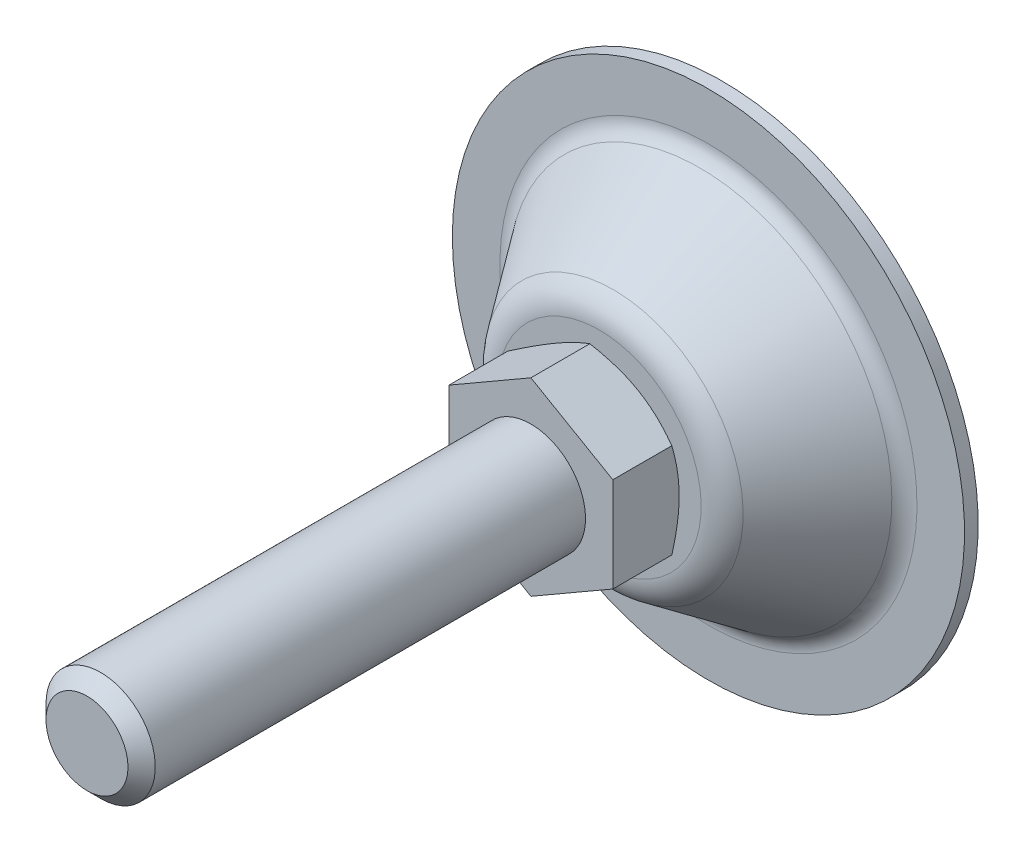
ISO-10303-21;
HEADER;
FILE_DESCRIPTION(('STEP AP214'),'2;1');
FILE_NAME('part.step','',(''),(''),'','','');
FILE_SCHEMA(('AUTOMOTIVE_DESIGN { 1 0 10303 214 1 1 1 1 }'));
ENDSEC;
DATA;
#1=APPLICATION_CONTEXT('core data for automotive mechanical design processes');
#2=APPLICATION_PROTOCOL_DEFINITION('international standard','automotive_design',2000,#1);
#3=PRODUCT_CONTEXT('',#1,'mechanical');
#4=PRODUCT('Part','Part','',(#3));
#5=PRODUCT_RELATED_PRODUCT_CATEGORY('part','',(#4));
#6=PRODUCT_DEFINITION_FORMATION('','',#4);
#7=PRODUCT_DEFINITION_CONTEXT('part definition',#1,'design');
#8=PRODUCT_DEFINITION('design','',#6,#7);
#9=PRODUCT_DEFINITION_SHAPE('','',#8);
#10=(LENGTH_UNIT() NAMED_UNIT(*) SI_UNIT(.MILLI.,.METRE.));
#11=(NAMED_UNIT(*) PLANE_ANGLE_UNIT() SI_UNIT($,.RADIAN.));
#12=(NAMED_UNIT(*) SI_UNIT($,.STERADIAN.) SOLID_ANGLE_UNIT());
#13=UNCERTAINTY_MEASURE_WITH_UNIT(LENGTH_MEASURE(1.E-05),#10,'distance_accuracy_value','');
#14=(GEOMETRIC_REPRESENTATION_CONTEXT(3) GLOBAL_UNCERTAINTY_ASSIGNED_CONTEXT((#13)) GLOBAL_UNIT_ASSIGNED_CONTEXT((#10,
#11,#12)) REPRESENTATION_CONTEXT('',''));
#15=CARTESIAN_POINT('',(0.,0.,0.));
#16=DIRECTION('',(0.,0.,1.));
#17=DIRECTION('',(1.,0.,0.));
#18=AXIS2_PLACEMENT_3D('',#15,#16,#17);
#19=CARTESIAN_POINT('',(0.,0.,28.));
#20=DIRECTION('',(0.,0.,1.));
#21=DIRECTION('',(0.5,-0.866025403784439,0.));
#22=AXIS2_PLACEMENT_3D('',#19,#20,#21);
#23=PLANE('',#22);
#24=DIRECTION('',(0.,1.,0.));
#25=VECTOR('',#24,1.);
#26=CARTESIAN_POINT('',(12.,-6.92820323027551,28.));
#27=LINE('',#26,#25);
#28=CARTESIAN_POINT('',(12.,-6.92820323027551,28.));
#29=VERTEX_POINT('',#28);
#30=CARTESIAN_POINT('',(12.,6.9282032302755,28.));
#31=VERTEX_POINT('',#30);
#32=EDGE_CURVE('E220',#29,#31,#27,.T.);
#33=ORIENTED_EDGE('',*,*,#32,.T.);
#34=DIRECTION('',(-0.866025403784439,0.5,0.));
#35=VECTOR('',#34,1.);
#36=CARTESIAN_POINT('',(12.,6.9282032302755,28.));
#37=LINE('',#36,#35);
#38=CARTESIAN_POINT('',(0.,13.856406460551,28.));
#39=VERTEX_POINT('',#38);
#40=EDGE_CURVE('E361',#31,#39,#37,.T.);
#41=ORIENTED_EDGE('',*,*,#40,.T.);
#42=DIRECTION('',(-0.866025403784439,-0.5,0.));
#43=VECTOR('',#42,1.);
#44=CARTESIAN_POINT('',(0.,13.856406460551,28.));
#45=LINE('',#44,#43);
#46=CARTESIAN_POINT('',(-12.,6.92820323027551,28.));
#47=VERTEX_POINT('',#46);
#48=EDGE_CURVE('E360',#39,#47,#45,.T.);
#49=ORIENTED_EDGE('',*,*,#48,.T.);
#50=DIRECTION('',(0.,-1.,0.));
#51=VECTOR('',#50,1.);
#52=CARTESIAN_POINT('',(-12.,6.92820323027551,28.));
#53=LINE('',#52,#51);
#54=CARTESIAN_POINT('',(-12.,-6.9282032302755,28.));
#55=VERTEX_POINT('',#54);
#56=EDGE_CURVE('E365',#47,#55,#53,.T.);
#57=ORIENTED_EDGE('',*,*,#56,.T.);
#58=DIRECTION('',(0.866025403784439,-0.5,0.));
#59=VECTOR('',#58,1.);
#60=CARTESIAN_POINT('',(-12.,-6.9282032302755,28.));
#61=LINE('',#60,#59);
#62=CARTESIAN_POINT('',(0.,-13.856406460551,28.));
#63=VERTEX_POINT('',#62);
#64=EDGE_CURVE('E367',#55,#63,#61,.T.);
#65=ORIENTED_EDGE('',*,*,#64,.T.);
#66=DIRECTION('',(0.866025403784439,0.5,0.));
#67=VECTOR('',#66,1.);
#68=CARTESIAN_POINT('',(0.,-13.856406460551,28.));
#69=LINE('',#68,#67);
#70=EDGE_CURVE('E37',#63,#29,#69,.T.);
#71=ORIENTED_EDGE('',*,*,#70,.T.);
#72=EDGE_LOOP('',(#33,#41,#49,#57,#65,#71));
#73=FACE_BOUND('',#72,.T.);
#74=CARTESIAN_POINT('',(0.,0.,28.));
#75=DIRECTION('',(0.,0.,1.));
#76=DIRECTION('',(0.5,-0.866025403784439,0.));
#77=AXIS2_PLACEMENT_3D('',#74,#75,#76);
#78=CIRCLE('',#77,8.);
#79=CARTESIAN_POINT('',(4.,-6.92820323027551,28.));
#80=VERTEX_POINT('',#79);
#81=EDGE_CURVE('E224',#80,#80,#78,.T.);
#82=ORIENTED_EDGE('',*,*,#81,.F.);
#83=EDGE_LOOP('',(#82));
#84=FACE_BOUND('',#83,.T.);
#85=ADVANCED_FACE('F14',(#73,#84),#23,.T.);
#86=CARTESIAN_POINT('',(-7.46811554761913,12.9351555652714,18.));
#87=DIRECTION('',(0.,0.,-1.));
#88=DIRECTION('',(-0.5,0.866025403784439,0.));
#89=AXIS2_PLACEMENT_3D('',#86,#87,#88);
#90=PLANE('',#89);
#91=CARTESIAN_POINT('',(-1.37317446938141E-13,2.37840794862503E-13,18.));
#92=DIRECTION('',(0.,0.,1.));
#93=DIRECTION('',(0.5,-0.866025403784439,0.));
#94=AXIS2_PLACEMENT_3D('',#91,#92,#93);
#95=CIRCLE('',#94,14.936231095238);
#96=CARTESIAN_POINT('',(7.46811554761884,-12.9351555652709,18.));
#97=VERTEX_POINT('',#96);
#98=EDGE_CURVE('E111',#97,#97,#95,.T.);
#99=ORIENTED_EDGE('',*,*,#98,.T.);
#100=EDGE_LOOP('',(#99));
#101=FACE_BOUND('',#100,.T.);
#102=CARTESIAN_POINT('',(0.,0.,18.));
#103=DIRECTION('',(0.,0.,-1.));
#104=DIRECTION('',(-0.5,0.866025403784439,0.));
#105=AXIS2_PLACEMENT_3D('',#102,#103,#104);
#106=CIRCLE('',#105,11.5);
#107=CARTESIAN_POINT('',(-5.75,9.95929214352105,18.));
#108=VERTEX_POINT('',#107);
#109=EDGE_CURVE('E84',#108,#108,#106,.T.);
#110=ORIENTED_EDGE('',*,*,#109,.T.);
#111=EDGE_LOOP('',(#110));
#112=FACE_BOUND('',#111,.T.);
#113=ADVANCED_FACE('F195',(#101,#112),#90,.F.);
#114=CARTESIAN_POINT('',(-1.54390389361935E-13,2.67411998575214E-13,4.9999999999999));
#115=DIRECTION('',(0.,0.,1.));
#116=DIRECTION('',(0.5,-0.866025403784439,0.));
#117=AXIS2_PLACEMENT_3D('',#114,#115,#116);
#118=TOROIDAL_SURFACE('',#117,30.5382613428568,3.);
#119=CARTESIAN_POINT('',(-1.55741344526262E-13,2.69751921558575E-13,3.24909185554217));
#120=DIRECTION('',(0.,0.,1.));
#121=DIRECTION('',(0.5,-0.866025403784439,0.));
#122=AXIS2_PLACEMENT_3D('',#119,#120,#121);
#123=CIRCLE('',#122,28.1022152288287);
#124=CARTESIAN_POINT('',(14.0511076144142,-24.3372322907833,3.2490918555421));
#125=VERTEX_POINT('',#124);
#126=EDGE_CURVE('E73',#125,#125,#123,.T.);
#127=ORIENTED_EDGE('',*,*,#126,.F.);
#128=EDGE_LOOP('',(#127));
#129=FACE_BOUND('',#128,.T.);
#130=CARTESIAN_POINT('',(-1.57301461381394E-13,2.72454123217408E-13,1.99999999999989));
#131=DIRECTION('',(0.,0.,1.));
#132=DIRECTION('',(0.5,-0.866025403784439,0.));
#133=AXIS2_PLACEMENT_3D('',#130,#131,#132);
#134=CIRCLE('',#133,30.5382613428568);
#135=CARTESIAN_POINT('',(15.2691306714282,-26.446910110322,1.99999999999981));
#136=VERTEX_POINT('',#135);
#137=EDGE_CURVE('E102',#136,#136,#134,.T.);
#138=ORIENTED_EDGE('',*,*,#137,.T.);
#139=EDGE_LOOP('',(#138));
#140=FACE_BOUND('',#139,.T.);
#141=ADVANCED_FACE('F198',(#129,#140),#118,.F.);
#142=CARTESIAN_POINT('',(-1.55741344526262E-13,2.69751921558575E-13,3.24909185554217));
#143=DIRECTION('',(0.,0.,-1.));
#144=DIRECTION('',(-0.5,0.866025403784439,0.));
#145=AXIS2_PLACEMENT_3D('',#142,#143,#144);
#146=CONICAL_SURFACE('',#145,28.1022152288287,0.623199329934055);
#147=CARTESIAN_POINT('',(-1.39917641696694E-13,2.42344464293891E-13,15.9181802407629));
#148=DIRECTION('',(0.,0.,1.));
#149=DIRECTION('',(0.5,-0.866025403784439,0.));
#150=AXIS2_PLACEMENT_3D('',#147,#148,#149);
#151=CIRCLE('',#150,18.9963079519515);
#152=CARTESIAN_POINT('',(9.49815397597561,-16.4512852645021,15.9181802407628));
#153=VERTEX_POINT('',#152);
#154=EDGE_CURVE('E114',#153,#153,#151,.T.);
#155=ORIENTED_EDGE('',*,*,#154,.F.);
#156=EDGE_LOOP('',(#155));
#157=FACE_BOUND('',#156,.T.);
#158=ORIENTED_EDGE('',*,*,#126,.T.);
#159=EDGE_LOOP('',(#158));
#160=FACE_BOUND('',#159,.T.);
#161=ADVANCED_FACE('F202',(#157,#160),#146,.T.);
#162=CARTESIAN_POINT('',(-1.43982048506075E-13,2.49384223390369E-13,13.));
#163=DIRECTION('',(0.,0.,1.));
#164=DIRECTION('',(0.5,-0.866025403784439,0.));
#165=AXIS2_PLACEMENT_3D('',#162,#163,#164);
#166=TOROIDAL_SURFACE('',#165,14.9362310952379,5.);
#167=ORIENTED_EDGE('',*,*,#98,.F.);
#168=EDGE_LOOP('',(#167));
#169=FACE_BOUND('',#168,.T.);
#170=ORIENTED_EDGE('',*,*,#154,.T.);
#171=EDGE_LOOP('',(#170));
#172=FACE_BOUND('',#171,.T.);
#173=ADVANCED_FACE('F193',(#169,#172),#166,.T.);
#174=CARTESIAN_POINT('',(-18.75,32.4759526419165,0.));
#175=DIRECTION('',(0.,0.,1.));
#176=DIRECTION('',(0.5,-0.866025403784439,0.));
#177=AXIS2_PLACEMENT_3D('',#174,#175,#176);
#178=PLANE('',#177);
#179=CARTESIAN_POINT('',(-1.59799463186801E-13,2.76780789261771E-13,-1.38777878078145E-13));
#180=DIRECTION('',(0.,0.,1.));
#181=DIRECTION('',(0.5,-0.866025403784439,0.));
#182=AXIS2_PLACEMENT_3D('',#179,#180,#181);
#183=CIRCLE('',#182,37.5);
#184=CARTESIAN_POINT('',(18.7499999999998,-32.4759526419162,-2.32452945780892E-13));
#185=VERTEX_POINT('',#184);
#186=EDGE_CURVE('E108',#185,#185,#183,.T.);
#187=ORIENTED_EDGE('',*,*,#186,.F.);
#188=EDGE_LOOP('',(#187));
#189=FACE_BOUND('',#188,.T.);
#190=ADVANCED_FACE('F189',(#189),#178,.F.);
#191=CARTESIAN_POINT('',(0.,0.,129.670029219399));
#192=DIRECTION('',(0.,0.,1.));
#193=DIRECTION('',(0.5,-0.866025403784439,0.));
#194=AXIS2_PLACEMENT_3D('',#191,#192,#193);
#195=CYLINDRICAL_SURFACE('',#194,37.5);
#196=CARTESIAN_POINT('',(-1.57301461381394E-13,2.72454123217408E-13,1.99999999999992));
#197=DIRECTION('',(0.,0.,1.));
#198=DIRECTION('',(0.5,-0.866025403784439,0.));
#199=AXIS2_PLACEMENT_3D('',#196,#197,#198);
#200=CIRCLE('',#199,37.5);
#201=CARTESIAN_POINT('',(18.7499999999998,-32.4759526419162,1.99999999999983));
#202=VERTEX_POINT('',#201);
#203=EDGE_CURVE('E105',#202,#202,#200,.T.);
#204=ORIENTED_EDGE('',*,*,#203,.F.);
#205=EDGE_LOOP('',(#204));
#206=FACE_BOUND('',#205,.T.);
#207=ORIENTED_EDGE('',*,*,#186,.T.);
#208=EDGE_LOOP('',(#207));
#209=FACE_BOUND('',#208,.T.);
#210=ADVANCED_FACE('F185',(#206,#209),#195,.T.);
#211=CARTESIAN_POINT('',(-18.75,32.4759526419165,2.));
#212=DIRECTION('',(0.,0.,-1.));
#213=DIRECTION('',(-0.5,0.866025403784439,0.));
#214=AXIS2_PLACEMENT_3D('',#211,#212,#213);
#215=PLANE('',#214);
#216=ORIENTED_EDGE('',*,*,#137,.F.);
#217=EDGE_LOOP('',(#216));
#218=FACE_BOUND('',#217,.T.);
#219=ORIENTED_EDGE('',*,*,#203,.T.);
#220=EDGE_LOOP('',(#219));
#221=FACE_BOUND('',#220,.T.);
#222=ADVANCED_FACE('F130',(#218,#221),#215,.F.);
#223=CARTESIAN_POINT('',(0.,0.,23.6283876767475));
#224=DIRECTION('',(0.,0.,1.));
#225=DIRECTION('',(0.5,-0.866025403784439,0.));
#226=AXIS2_PLACEMENT_3D('',#223,#224,#225);
#227=CONICAL_SURFACE('',#226,21.2486534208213,1.0471975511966);
#228=ORIENTED_EDGE('',*,*,#109,.F.);
#229=EDGE_LOOP('',(#228));
#230=FACE_BOUND('',#229,.T.);
#231=CARTESIAN_POINT('',(-10.0532557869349,-19.6606563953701,24.1094504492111));
#232=CARTESIAN_POINT('',(-9.82653838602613,-19.5297610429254,23.9825738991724));
#233=CARTESIAN_POINT('',(-9.59955317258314,-19.398711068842,23.856335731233));
#234=CARTESIAN_POINT('',(-9.14499119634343,-19.1362695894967,23.6052809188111));
#235=CARTESIAN_POINT('',(-8.91741442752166,-19.0048780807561,23.4804642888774));
#236=CARTESIAN_POINT('',(-8.23365135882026,-18.6101072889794,23.1083304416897));
#237=CARTESIAN_POINT('',(-7.77650041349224,-18.346171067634,22.8633674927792));
#238=CARTESIAN_POINT('',(-6.85659953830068,-17.8150660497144,22.3798814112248));
#239=CARTESIAN_POINT('',(-6.39383263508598,-17.5478874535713,22.1414012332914));
#240=CARTESIAN_POINT('',(-5.46459534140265,-17.0113920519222,21.6742979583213));
#241=CARTESIAN_POINT('',(-4.9981251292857,-16.7420753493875,21.4456743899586));
#242=CARTESIAN_POINT('',(-4.04609504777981,-16.1924205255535,20.9939474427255));
#243=CARTESIAN_POINT('',(-3.56039382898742,-15.912000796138,20.7712391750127));
#244=CARTESIAN_POINT('',(-2.58328268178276,-15.3478654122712,20.3428555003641));
#245=CARTESIAN_POINT('',(-2.09187211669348,-15.0641493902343,20.137182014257));
#246=CARTESIAN_POINT('',(-1.10351639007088,-14.4935219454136,19.7483225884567));
#247=CARTESIAN_POINT('',(-0.606584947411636,-14.2066184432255,19.565090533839));
#248=CARTESIAN_POINT('',(0.394451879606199,-13.628669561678,19.2270309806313));
#249=CARTESIAN_POINT('',(0.898554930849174,-13.3376255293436,19.072194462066));
#250=CARTESIAN_POINT('',(1.65882416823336,-12.8986838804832,18.8672836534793));
#251=CARTESIAN_POINT('',(1.91226998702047,-12.7523568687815,18.8036673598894));
#252=CARTESIAN_POINT('',(2.42088138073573,-12.4587099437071,18.6863216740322));
#253=CARTESIAN_POINT('',(2.6760469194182,-12.3113900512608,18.6325920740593));
#254=CARTESIAN_POINT('',(3.18791661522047,-12.0158619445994,18.5359727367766));
#255=CARTESIAN_POINT('',(3.44462075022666,-11.8676537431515,18.4930828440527));
#256=CARTESIAN_POINT('',(3.95929088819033,-11.5705088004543,18.4190010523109));
#257=CARTESIAN_POINT('',(4.2172568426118,-11.4215720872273,18.3878087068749));
#258=CARTESIAN_POINT('',(4.73074751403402,-11.1251081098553,18.3381289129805));
#259=CARTESIAN_POINT('',(4.98626060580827,-10.977587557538,18.319482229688));
#260=CARTESIAN_POINT('',(5.49773994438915,-10.6822848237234,18.294677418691));
#261=CARTESIAN_POINT('',(5.75370618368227,-10.534502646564,18.2885190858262));
#262=CARTESIAN_POINT('',(6.26563805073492,-10.2389386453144,18.2888371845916));
#263=CARTESIAN_POINT('',(6.5216036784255,-10.091156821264,18.295313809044));
#264=CARTESIAN_POINT('',(7.03307268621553,-9.79586005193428,18.3207453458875));
#265=CARTESIAN_POINT('',(7.28857604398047,-9.64834511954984,18.3397008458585));
#266=CARTESIAN_POINT('',(7.90442793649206,-9.29278286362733,18.4000305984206));
#267=CARTESIAN_POINT('',(8.26434066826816,-9.08498715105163,18.4474404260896));
#268=CARTESIAN_POINT('',(8.98145632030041,-8.67096023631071,18.5644233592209));
#269=CARTESIAN_POINT('',(9.33865885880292,-8.46472925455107,18.6339995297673));
#270=CARTESIAN_POINT('',(10.0500214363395,-8.0540238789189,18.7928402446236));
#271=CARTESIAN_POINT('',(10.4041788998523,-7.84955097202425,18.8821200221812));
#272=CARTESIAN_POINT('',(11.1089234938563,-7.44266649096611,19.077650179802));
#273=CARTESIAN_POINT('',(11.4595106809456,-7.24025488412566,19.1839002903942));
#274=CARTESIAN_POINT('',(12.1650627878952,-6.83290418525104,19.4133803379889));
#275=CARTESIAN_POINT('',(12.5199465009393,-6.62801197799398,19.5369408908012));
#276=CARTESIAN_POINT('',(13.2262157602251,-6.22024723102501,19.7966751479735));
#277=CARTESIAN_POINT('',(13.5776012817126,-6.01737470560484,19.9328489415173));
#278=CARTESIAN_POINT('',(14.2770536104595,-5.61354571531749,20.2156602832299));
#279=CARTESIAN_POINT('',(14.6251214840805,-5.41258863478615,20.3622943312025));
#280=CARTESIAN_POINT('',(15.318378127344,-5.01233672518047,20.664315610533));
#281=CARTESIAN_POINT('',(15.6635669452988,-4.81304186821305,20.8197026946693));
#282=CARTESIAN_POINT('',(16.5374507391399,-4.30850482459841,21.2238005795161));
#283=CARTESIAN_POINT('',(17.0644049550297,-4.00426766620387,21.477525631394));
#284=CARTESIAN_POINT('',(18.1134107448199,-3.39862389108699,21.9981888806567));
#285=CARTESIAN_POINT('',(18.635461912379,-3.097217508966,22.2651281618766));
#286=CARTESIAN_POINT('',(19.6756923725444,-2.49664017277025,22.8093074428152));
#287=CARTESIAN_POINT('',(20.1938705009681,-2.19746989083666,23.0865504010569));
#288=CARTESIAN_POINT('',(21.226926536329,-1.60103471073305,23.6490491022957));
#289=CARTESIAN_POINT('',(21.7418045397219,-1.30376975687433,23.9343046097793));
#290=CARTESIAN_POINT('',(22.7695382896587,-0.710407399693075,24.5115723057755));
#291=CARTESIAN_POINT('',(23.2823905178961,-0.414312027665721,24.8035928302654));
#292=CARTESIAN_POINT('',(24.3058697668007,0.176593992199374,25.3927886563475));
#293=CARTESIAN_POINT('',(24.8164967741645,0.471404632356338,25.689963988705));
#294=CARTESIAN_POINT('',(25.835813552,1.05990744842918,26.2884658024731));
#295=CARTESIAN_POINT('',(26.3445036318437,1.35359980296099,26.5897915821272));
#296=CARTESIAN_POINT('',(27.3603325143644,1.94008888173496,27.1959115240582));
#297=CARTESIAN_POINT('',(27.8674713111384,2.23288560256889,27.5007056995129));
#298=CARTESIAN_POINT('',(29.2909254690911,3.05471724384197,28.3613531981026));
#299=CARTESIAN_POINT('',(30.2057559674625,3.58289487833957,28.9204806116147));
#300=CARTESIAN_POINT('',(32.0322611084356,4.63742811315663,30.0456673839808));
#301=CARTESIAN_POINT('',(32.9439356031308,5.16378362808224,30.6117270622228));
#302=CARTESIAN_POINT('',(34.7622656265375,6.2135969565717,31.7474746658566));
#303=CARTESIAN_POINT('',(35.6689280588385,6.73705875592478,32.3171478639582));
#304=CARTESIAN_POINT('',(37.0274616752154,7.52140850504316,33.174659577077));
#305=CARTESIAN_POINT('',(37.4800486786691,7.78270973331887,33.4609880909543));
#306=CARTESIAN_POINT('',(38.3847950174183,8.30506527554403,34.0345430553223));
#307=CARTESIAN_POINT('',(38.8369543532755,8.5661195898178,34.3217695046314));
#308=CARTESIAN_POINT('',(39.2889251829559,8.82706506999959,34.6093910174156));
#309=B_SPLINE_CURVE_WITH_KNOTS('',3,(#231,#232,#233,#234,#235,#236,#237,#238,#239,#240,#241,
#242,#243,#244,#245,#246,#247,#248,#249,#250,#251,#252,#253,#254,#255,#256,#257,#258,#259,#260,
#261,#262,#263,#264,#265,#266,#267,#268,#269,#270,#271,#272,#273,#274,#275,#276,#277,#278,#279,
#280,#281,#282,#283,#284,#285,#286,#287,#288,#289,#290,#291,#292,#293,#294,#295,#296,#297,#298,
#299,#300,#301,#302,#303,#304,#305,#306,#307,#308),.UNSPECIFIED.,.F.,.F.,(4,2,2,2,2,2,2,2,2,2,2,
2,2,2,2,2,2,2,2,2,2,2,2,2,2,2,2,2,2,2,2,2,2,2,2,2,2,2,4),(0.,0.872745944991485,1.74550081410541,
3.49127289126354,5.24667070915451,7.00198449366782,8.81209333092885,10.6224059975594,
12.4289339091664,14.2348869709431,15.1332127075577,16.0315195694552,16.929813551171,
17.8280732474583,18.7147052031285,19.6013225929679,20.4879535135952,21.3746261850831,
22.6287917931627,23.88313089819,25.1384431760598,26.3937355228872,27.6775150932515,
28.9613037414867,30.2446648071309,31.5280042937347,33.5055452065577,35.4832485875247,
37.4615242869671,39.439741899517,41.4205425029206,43.4013549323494,45.3818364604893,
47.3623255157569,50.9478944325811,54.5336291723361,58.1092552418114,59.8969559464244,
61.6846542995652),.UNSPECIFIED.);
#310=CARTESIAN_POINT('',(0.,-13.856406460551,19.3604719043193));
#311=VERTEX_POINT('',#310);
#312=CARTESIAN_POINT('',(12.,-6.92820323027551,19.3604719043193));
#313=VERTEX_POINT('',#312);
#314=EDGE_CURVE('E65',#311,#313,#309,.T.);
#315=ORIENTED_EDGE('',*,*,#314,.F.);
#316=CARTESIAN_POINT('',(-12.0002,-6.92808776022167,19.3605385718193));
#317=CARTESIAN_POINT('',(-11.7364142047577,-7.08038456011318,19.2726247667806));
#318=CARTESIAN_POINT('',(-11.4716448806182,-7.2332492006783,19.1887011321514));
#319=CARTESIAN_POINT('',(-10.9399829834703,-7.54020434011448,19.0299413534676));
#320=CARTESIAN_POINT('',(-10.6730897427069,-7.69429522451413,18.9551081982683));
#321=CARTESIAN_POINT('',(-9.86810959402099,-8.15905073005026,18.7456926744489));
#322=CARTESIAN_POINT('',(-9.32684492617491,-8.47155003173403,18.6265783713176));
#323=CARTESIAN_POINT('',(-8.51686717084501,-8.93919090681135,18.4869061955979));
#324=CARTESIAN_POINT('',(-8.25057389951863,-9.09293539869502,18.4471189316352));
#325=CARTESIAN_POINT('',(-7.71675440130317,-9.40113622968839,18.3803985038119));
#326=CARTESIAN_POINT('',(-7.44922815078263,-9.55559258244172,18.3534655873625));
#327=CARTESIAN_POINT('',(-6.91372963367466,-9.86476279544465,18.3131437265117));
#328=CARTESIAN_POINT('',(-6.64575827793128,-10.0194761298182,18.2997386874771));
#329=CARTESIAN_POINT('',(-6.10956726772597,-10.3290461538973,18.2867582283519));
#330=CARTESIAN_POINT('',(-5.84134762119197,-10.4839028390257,18.2871823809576));
#331=CARTESIAN_POINT('',(-5.3399106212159,-10.7734076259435,18.3008951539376));
#332=CARTESIAN_POINT('',(-5.10665750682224,-10.908076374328,18.3125111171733));
#333=CARTESIAN_POINT('',(-4.64068775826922,-11.1771041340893,18.3459831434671));
#334=CARTESIAN_POINT('',(-4.40797116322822,-11.3114631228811,18.367839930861));
#335=CARTESIAN_POINT('',(-3.94320092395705,-11.5797983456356,18.4214125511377));
#336=CARTESIAN_POINT('',(-3.71114798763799,-11.7137741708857,18.4531365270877));
#337=CARTESIAN_POINT('',(-3.24813003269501,-11.9810977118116,18.5258869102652));
#338=CARTESIAN_POINT('',(-3.01716508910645,-12.1144453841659,18.566913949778));
#339=CARTESIAN_POINT('',(-2.31605804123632,-12.5192297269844,18.7049867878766));
#340=CARTESIAN_POINT('',(-1.84794625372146,-12.789494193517,18.8158000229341));
#341=CARTESIAN_POINT('',(-0.918702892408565,-13.3259930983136,19.0673009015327));
#342=CARTESIAN_POINT('',(-0.457559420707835,-13.5922344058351,19.2079294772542));
#343=CARTESIAN_POINT('',(0.000199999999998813,-13.8565219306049,19.3605385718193));
#344=B_SPLINE_CURVE_WITH_KNOTS('',3,(#316,#317,#318,#319,#320,#321,#322,#323,#324,#325,#326,
#327,#328,#329,#330,#331,#332,#333,#334,#335,#336,#337,#338,#339,#340,#341,#342,#343),
.UNSPECIFIED.,.F.,.F.,(4,2,2,2,2,2,2,2,2,2,2,2,2,4),(0.,0.951004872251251,1.90232158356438,
3.80900466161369,4.73894551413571,5.6689042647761,6.59775529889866,7.52657763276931,
8.3351464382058,9.14377244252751,9.95306755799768,10.7624176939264,12.4167102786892,
14.0677556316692),.UNSPECIFIED.);
#345=CARTESIAN_POINT('',(-12.,-6.9282032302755,19.3604719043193));
#346=VERTEX_POINT('',#345);
#347=EDGE_CURVE('E68',#346,#311,#344,.T.);
#348=ORIENTED_EDGE('',*,*,#347,.F.);
#349=CARTESIAN_POINT('',(-12.,6.92843417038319,19.3605385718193));
#350=CARTESIAN_POINT('',(-12.,6.62384057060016,19.2726247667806));
#351=CARTESIAN_POINT('',(-12.,6.31811128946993,19.1887011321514));
#352=CARTESIAN_POINT('',(-12.,5.70420101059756,19.0299413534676));
#353=CARTESIAN_POINT('',(-12.,5.39601924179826,18.9551081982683));
#354=CARTESIAN_POINT('',(-12.,4.466508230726,18.7456926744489));
#355=CARTESIAN_POINT('',(-12.,3.84150962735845,18.6265783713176));
#356=CARTESIAN_POINT('',(-12.,2.9062278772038,18.4869061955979));
#357=CARTESIAN_POINT('',(-12.,2.59873889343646,18.4471189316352));
#358=CARTESIAN_POINT('',(-12.,1.98233723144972,18.3803985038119));
#359=CARTESIAN_POINT('',(-12.,1.67342452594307,18.3534655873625));
#360=CARTESIAN_POINT('',(-12.,1.05508409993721,18.3131437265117));
#361=CARTESIAN_POINT('',(-12.,0.745657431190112,18.2997386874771));
#362=CARTESIAN_POINT('',(-12.,0.126517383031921,18.2867582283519));
#363=CARTESIAN_POINT('',(-12.,-0.183195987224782,18.2871823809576));
#364=CARTESIAN_POINT('',(-12.,-0.762205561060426,18.3008951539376));
#365=CARTESIAN_POINT('',(-12.,-1.03154305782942,18.3125111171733));
#366=CARTESIAN_POINT('',(-12.,-1.56959857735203,18.3459831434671));
#367=CARTESIAN_POINT('',(-12.,-1.83831655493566,18.367839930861));
#368=CARTESIAN_POINT('',(-12.,-2.37498700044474,18.4214125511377));
#369=CARTESIAN_POINT('',(-12.,-2.64293865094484,18.4531365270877));
#370=CARTESIAN_POINT('',(-12.,-3.17758573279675,18.5258869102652));
#371=CARTESIAN_POINT('',(-12.,-3.4442810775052,18.566913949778));
#372=CARTESIAN_POINT('',(-12.,-4.25384976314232,18.7049867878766));
#373=CARTESIAN_POINT('',(-12.,-4.79437869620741,18.8158000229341));
#374=CARTESIAN_POINT('',(-12.,-5.86737650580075,19.0673009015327));
#375=CARTESIAN_POINT('',(-12.,-6.39985912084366,19.2079294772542));
#376=CARTESIAN_POINT('',(-12.,-6.92843417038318,19.3605385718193));
#377=B_SPLINE_CURVE_WITH_KNOTS('',3,(#349,#350,#351,#352,#353,#354,#355,#356,#357,#358,#359,
#360,#361,#362,#363,#364,#365,#366,#367,#368,#369,#370,#371,#372,#373,#374,#375,#376),
.UNSPECIFIED.,.F.,.F.,(4,2,2,2,2,2,2,2,2,2,2,2,2,4),(0.,0.951004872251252,1.90232158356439,
3.80900466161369,4.73894551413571,5.6689042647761,6.59775529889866,7.52657763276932,
8.3351464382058,9.14377244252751,9.95306755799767,10.7624176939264,12.4167102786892,
14.0677556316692),.UNSPECIFIED.);
#378=CARTESIAN_POINT('',(-12.,6.92820323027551,19.3604719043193));
#379=VERTEX_POINT('',#378);
#380=EDGE_CURVE('E83',#379,#346,#377,.T.);
#381=ORIENTED_EDGE('',*,*,#380,.F.);
#382=CARTESIAN_POINT('',(-22.0532557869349,1.12395329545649,24.1094504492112));
#383=CARTESIAN_POINT('',(-21.8265383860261,1.25484864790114,23.9825738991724));
#384=CARTESIAN_POINT('',(-21.5995531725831,1.38589862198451,23.856335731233));
#385=CARTESIAN_POINT('',(-21.1449911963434,1.64834010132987,23.6052809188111));
#386=CARTESIAN_POINT('',(-20.9174144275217,1.77973161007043,23.4804642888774));
#387=CARTESIAN_POINT('',(-20.2336513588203,2.1745024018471,23.1083304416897));
#388=CARTESIAN_POINT('',(-19.7765004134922,2.43843862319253,22.8633674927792));
#389=CARTESIAN_POINT('',(-18.8565995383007,2.96954364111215,22.3798814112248));
#390=CARTESIAN_POINT('',(-18.393832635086,3.23672223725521,22.1414012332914));
#391=CARTESIAN_POINT('',(-17.4645953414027,3.77321763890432,21.6742979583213));
#392=CARTESIAN_POINT('',(-16.9981251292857,4.04253434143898,21.4456743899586));
#393=CARTESIAN_POINT('',(-16.0460950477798,4.59218916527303,20.9939474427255));
#394=CARTESIAN_POINT('',(-15.5603938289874,4.87260889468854,20.7712391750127));
#395=CARTESIAN_POINT('',(-14.5832826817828,5.43674427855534,20.3428555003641));
#396=CARTESIAN_POINT('',(-14.0918721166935,5.72046030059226,20.137182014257));
#397=CARTESIAN_POINT('',(-13.1035163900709,6.29108774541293,19.7483225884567));
#398=CARTESIAN_POINT('',(-12.6065849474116,6.57799124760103,19.565090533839));
#399=CARTESIAN_POINT('',(-11.6055481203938,7.1559401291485,19.2270309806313));
#400=CARTESIAN_POINT('',(-11.1014450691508,7.44698416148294,19.072194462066));
#401=CARTESIAN_POINT('',(-10.3411758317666,7.8859258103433,18.8672836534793));
#402=CARTESIAN_POINT('',(-10.0877300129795,8.03225282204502,18.8036673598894));
#403=CARTESIAN_POINT('',(-9.57911861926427,8.32589974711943,18.6863216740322));
#404=CARTESIAN_POINT('',(-9.3239530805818,8.47321963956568,18.6325920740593));
#405=CARTESIAN_POINT('',(-8.81208338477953,8.76874774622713,18.5359727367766));
#406=CARTESIAN_POINT('',(-8.55537924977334,8.91695594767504,18.4930828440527));
#407=CARTESIAN_POINT('',(-8.04070911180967,9.21410089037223,18.4190010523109));
#408=CARTESIAN_POINT('',(-7.78274315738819,9.36303760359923,18.3878087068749));
#409=CARTESIAN_POINT('',(-7.26925248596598,9.6595015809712,18.3381289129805));
#410=CARTESIAN_POINT('',(-7.01373939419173,9.80702213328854,18.319482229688));
#411=CARTESIAN_POINT('',(-6.50226005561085,10.1023248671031,18.294677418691));
#412=CARTESIAN_POINT('',(-6.24629381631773,10.2501070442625,18.2885190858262));
#413=CARTESIAN_POINT('',(-5.73436194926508,10.5456710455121,18.2888371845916));
#414=CARTESIAN_POINT('',(-5.4783963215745,10.6934528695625,18.295313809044));
#415=CARTESIAN_POINT('',(-4.96692731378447,10.9887496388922,18.3207453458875));
#416=CARTESIAN_POINT('',(-4.71142395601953,11.1362645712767,18.3397008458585));
#417=CARTESIAN_POINT('',(-4.09557206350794,11.4918268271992,18.4000305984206));
#418=CARTESIAN_POINT('',(-3.73565933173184,11.6996225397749,18.4474404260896));
#419=CARTESIAN_POINT('',(-3.01854367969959,12.1136494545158,18.5644233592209));
#420=CARTESIAN_POINT('',(-2.66134114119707,12.3198804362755,18.6339995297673));
#421=CARTESIAN_POINT('',(-1.9499785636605,12.7305858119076,18.7928402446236));
#422=CARTESIAN_POINT('',(-1.59582110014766,12.9350587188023,18.8821200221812));
#423=CARTESIAN_POINT('',(-0.891076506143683,13.3419431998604,19.077650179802));
#424=CARTESIAN_POINT('',(-0.540489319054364,13.5443548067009,19.1839002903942));
#425=CARTESIAN_POINT('',(0.165062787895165,13.9517055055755,19.4133803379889));
#426=CARTESIAN_POINT('',(0.519946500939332,14.1565977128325,19.5369408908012));
#427=CARTESIAN_POINT('',(1.22621576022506,14.5643624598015,19.7966751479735));
#428=CARTESIAN_POINT('',(1.57760128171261,14.7672349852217,19.9328489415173));
#429=CARTESIAN_POINT('',(2.27705361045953,15.171063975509,20.2156602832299));
#430=CARTESIAN_POINT('',(2.62512148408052,15.3720210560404,20.3622943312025));
#431=CARTESIAN_POINT('',(3.31837812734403,15.7722729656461,20.664315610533));
#432=CARTESIAN_POINT('',(3.66356694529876,15.9715678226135,20.8197026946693));
#433=CARTESIAN_POINT('',(4.53745073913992,16.4761048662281,21.2238005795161));
#434=CARTESIAN_POINT('',(5.06440495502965,16.7803420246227,21.477525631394));
#435=CARTESIAN_POINT('',(6.1134107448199,17.3859857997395,21.9981888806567));
#436=CARTESIAN_POINT('',(6.63546191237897,17.6873921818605,22.2651281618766));
#437=CARTESIAN_POINT('',(7.67569237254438,18.2879695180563,22.8093074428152));
#438=CARTESIAN_POINT('',(8.19387050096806,18.5871397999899,23.0865504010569));
#439=CARTESIAN_POINT('',(9.22692653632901,19.1835749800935,23.6490491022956));
#440=CARTESIAN_POINT('',(9.74180453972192,19.4808399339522,23.9343046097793));
#441=CARTESIAN_POINT('',(10.7695382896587,20.0742022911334,24.5115723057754));
#442=CARTESIAN_POINT('',(11.2823905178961,20.3702976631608,24.8035928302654));
#443=CARTESIAN_POINT('',(12.3058697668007,20.9612036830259,25.3927886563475));
#444=CARTESIAN_POINT('',(12.8164967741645,21.2560143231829,25.689963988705));
#445=CARTESIAN_POINT('',(13.835813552,21.8445171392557,26.2884658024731));
#446=CARTESIAN_POINT('',(14.3445036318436,22.1382094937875,26.5897915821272));
#447=CARTESIAN_POINT('',(15.3603325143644,22.7246985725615,27.1959115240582));
#448=CARTESIAN_POINT('',(15.8674713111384,23.0174952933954,27.5007056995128));
#449=CARTESIAN_POINT('',(17.2909254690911,23.8393269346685,28.3613531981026));
#450=CARTESIAN_POINT('',(18.2057559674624,24.3675045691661,28.9204806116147));
#451=CARTESIAN_POINT('',(20.0322611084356,25.4220378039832,30.0456673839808));
#452=CARTESIAN_POINT('',(20.9439356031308,25.9483933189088,30.6117270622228));
#453=CARTESIAN_POINT('',(22.7622656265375,26.9982066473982,31.7474746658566));
#454=CARTESIAN_POINT('',(23.6689280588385,27.5216684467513,32.3171478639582));
#455=CARTESIAN_POINT('',(25.0274616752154,28.3060181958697,33.1746595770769));
#456=CARTESIAN_POINT('',(25.4800486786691,28.5673194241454,33.4609880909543));
#457=CARTESIAN_POINT('',(26.3847950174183,29.0896749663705,34.0345430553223));
#458=CARTESIAN_POINT('',(26.8369543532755,29.3507292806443,34.3217695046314));
#459=CARTESIAN_POINT('',(27.2889251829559,29.6116747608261,34.6093910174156));
#460=B_SPLINE_CURVE_WITH_KNOTS('',3,(#382,#383,#384,#385,#386,#387,#388,#389,#390,#391,#392,
#393,#394,#395,#396,#397,#398,#399,#400,#401,#402,#403,#404,#405,#406,#407,#408,#409,#410,#411,
#412,#413,#414,#415,#416,#417,#418,#419,#420,#421,#422,#423,#424,#425,#426,#427,#428,#429,#430,
#431,#432,#433,#434,#435,#436,#437,#438,#439,#440,#441,#442,#443,#444,#445,#446,#447,#448,#449,
#450,#451,#452,#453,#454,#455,#456,#457,#458,#459),.UNSPECIFIED.,.F.,.F.,(4,2,2,2,2,2,2,2,2,2,2,
2,2,2,2,2,2,2,2,2,2,2,2,2,2,2,2,2,2,2,2,2,2,2,2,2,2,2,4),(0.,0.872745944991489,1.74550081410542,
3.49127289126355,5.24667070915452,7.00198449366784,8.81209333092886,10.6224059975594,
12.4289339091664,14.2348869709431,15.1332127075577,16.0315195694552,16.9298135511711,
17.8280732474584,18.7147052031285,19.6013225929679,20.4879535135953,21.3746261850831,
22.6287917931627,23.88313089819,25.1384431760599,26.3937355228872,27.6775150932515,
28.9613037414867,30.244664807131,31.5280042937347,33.5055452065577,35.4832485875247,
37.4615242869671,39.439741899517,41.4205425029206,43.4013549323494,45.3818364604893,
47.3623255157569,50.9478944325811,54.5336291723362,58.1092552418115,59.8969559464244,
61.6846542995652),.UNSPECIFIED.);
#461=CARTESIAN_POINT('',(0.,13.856406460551,19.3604719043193));
#462=VERTEX_POINT('',#461);
#463=EDGE_CURVE('E152',#462,#379,#460,.F.);
#464=ORIENTED_EDGE('',*,*,#463,.F.);
#465=CARTESIAN_POINT('',(12.0002,6.92808776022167,19.3605385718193));
#466=CARTESIAN_POINT('',(11.7364142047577,7.08038456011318,19.2726247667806));
#467=CARTESIAN_POINT('',(11.4716448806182,7.2332492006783,19.1887011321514));
#468=CARTESIAN_POINT('',(10.9399829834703,7.54020434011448,19.0299413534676));
#469=CARTESIAN_POINT('',(10.6730897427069,7.69429522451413,18.9551081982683));
#470=CARTESIAN_POINT('',(9.86810959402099,8.15905073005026,18.7456926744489));
#471=CARTESIAN_POINT('',(9.32684492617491,8.47155003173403,18.6265783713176));
#472=CARTESIAN_POINT('',(8.51686717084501,8.93919090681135,18.4869061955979));
#473=CARTESIAN_POINT('',(8.25057389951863,9.09293539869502,18.4471189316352));
#474=CARTESIAN_POINT('',(7.71675440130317,9.40113622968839,18.3803985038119));
#475=CARTESIAN_POINT('',(7.44922815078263,9.55559258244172,18.3534655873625));
#476=CARTESIAN_POINT('',(6.91372963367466,9.86476279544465,18.3131437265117));
#477=CARTESIAN_POINT('',(6.64575827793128,10.0194761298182,18.2997386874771));
#478=CARTESIAN_POINT('',(6.10956726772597,10.3290461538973,18.2867582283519));
#479=CARTESIAN_POINT('',(5.84134762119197,10.4839028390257,18.2871823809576));
#480=CARTESIAN_POINT('',(5.3399106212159,10.7734076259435,18.3008951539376));
#481=CARTESIAN_POINT('',(5.10665750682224,10.908076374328,18.3125111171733));
#482=CARTESIAN_POINT('',(4.64068775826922,11.1771041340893,18.3459831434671));
#483=CARTESIAN_POINT('',(4.40797116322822,11.3114631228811,18.367839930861));
#484=CARTESIAN_POINT('',(3.94320092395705,11.5797983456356,18.4214125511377));
#485=CARTESIAN_POINT('',(3.71114798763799,11.7137741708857,18.4531365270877));
#486=CARTESIAN_POINT('',(3.24813003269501,11.9810977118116,18.5258869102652));
#487=CARTESIAN_POINT('',(3.01716508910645,12.1144453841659,18.566913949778));
#488=CARTESIAN_POINT('',(2.31605804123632,12.5192297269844,18.7049867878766));
#489=CARTESIAN_POINT('',(1.84794625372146,12.789494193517,18.8158000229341));
#490=CARTESIAN_POINT('',(0.918702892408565,13.3259930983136,19.0673009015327));
#491=CARTESIAN_POINT('',(0.457559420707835,13.5922344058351,19.2079294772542));
#492=CARTESIAN_POINT('',(-0.000199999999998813,13.8565219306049,19.3605385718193));
#493=B_SPLINE_CURVE_WITH_KNOTS('',3,(#465,#466,#467,#468,#469,#470,#471,#472,#473,#474,#475,
#476,#477,#478,#479,#480,#481,#482,#483,#484,#485,#486,#487,#488,#489,#490,#491,#492),
.UNSPECIFIED.,.F.,.F.,(4,2,2,2,2,2,2,2,2,2,2,2,2,4),(0.,0.951004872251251,1.90232158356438,
3.80900466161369,4.73894551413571,5.6689042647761,6.59775529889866,7.52657763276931,
8.3351464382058,9.14377244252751,9.95306755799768,10.7624176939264,12.4167102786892,
14.0677556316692),.UNSPECIFIED.);
#494=CARTESIAN_POINT('',(12.,6.9282032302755,19.3604719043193));
#495=VERTEX_POINT('',#494);
#496=EDGE_CURVE('E159',#495,#462,#493,.T.);
#497=ORIENTED_EDGE('',*,*,#496,.F.);
#498=CARTESIAN_POINT('',(12.,-6.92843417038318,19.3605385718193));
#499=CARTESIAN_POINT('',(12.,-6.62384057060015,19.2726247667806));
#500=CARTESIAN_POINT('',(12.,-6.31811128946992,19.1887011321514));
#501=CARTESIAN_POINT('',(12.,-5.70420101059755,19.0299413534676));
#502=CARTESIAN_POINT('',(12.,-5.39601924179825,18.9551081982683));
#503=CARTESIAN_POINT('',(12.,-4.46650823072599,18.7456926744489));
#504=CARTESIAN_POINT('',(12.,-3.84150962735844,18.6265783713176));
#505=CARTESIAN_POINT('',(12.,-2.9062278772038,18.4869061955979));
#506=CARTESIAN_POINT('',(12.,-2.59873889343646,18.4471189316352));
#507=CARTESIAN_POINT('',(12.,-1.98233723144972,18.3803985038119));
#508=CARTESIAN_POINT('',(12.,-1.67342452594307,18.3534655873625));
#509=CARTESIAN_POINT('',(12.,-1.05508409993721,18.3131437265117));
#510=CARTESIAN_POINT('',(12.,-0.745657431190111,18.2997386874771));
#511=CARTESIAN_POINT('',(12.,-0.12651738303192,18.2867582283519));
#512=CARTESIAN_POINT('',(12.,0.183195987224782,18.2871823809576));
#513=CARTESIAN_POINT('',(12.,0.762205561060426,18.3008951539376));
#514=CARTESIAN_POINT('',(12.,1.03154305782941,18.3125111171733));
#515=CARTESIAN_POINT('',(12.,1.56959857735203,18.3459831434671));
#516=CARTESIAN_POINT('',(12.,1.83831655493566,18.367839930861));
#517=CARTESIAN_POINT('',(12.,2.37498700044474,18.4214125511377));
#518=CARTESIAN_POINT('',(12.,2.64293865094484,18.4531365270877));
#519=CARTESIAN_POINT('',(12.,3.17758573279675,18.5258869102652));
#520=CARTESIAN_POINT('',(12.,3.4442810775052,18.566913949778));
#521=CARTESIAN_POINT('',(12.,4.25384976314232,18.7049867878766));
#522=CARTESIAN_POINT('',(12.,4.79437869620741,18.8158000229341));
#523=CARTESIAN_POINT('',(12.,5.86737650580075,19.0673009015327));
#524=CARTESIAN_POINT('',(12.,6.39985912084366,19.2079294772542));
#525=CARTESIAN_POINT('',(12.,6.92843417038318,19.3605385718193));
#526=B_SPLINE_CURVE_WITH_KNOTS('',3,(#498,#499,#500,#501,#502,#503,#504,#505,#506,#507,#508,
#509,#510,#511,#512,#513,#514,#515,#516,#517,#518,#519,#520,#521,#522,#523,#524,#525),
.UNSPECIFIED.,.F.,.F.,(4,2,2,2,2,2,2,2,2,2,2,2,2,4),(0.,0.951004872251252,1.90232158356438,
3.80900466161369,4.7389455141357,5.66890426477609,6.59775529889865,7.52657763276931,
8.33514643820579,9.1437724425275,9.95306755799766,10.7624176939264,12.4167102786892,
14.0677556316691),.UNSPECIFIED.);
#527=EDGE_CURVE('E29',#313,#495,#526,.T.);
#528=ORIENTED_EDGE('',*,*,#527,.F.);
#529=EDGE_LOOP('',(#315,#348,#381,#464,#497,#528));
#530=FACE_BOUND('',#529,.T.);
#531=ADVANCED_FACE('F67',(#230,#530),#227,.T.);
#532=CARTESIAN_POINT('',(0.,-13.856406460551,28.));
#533=DIRECTION('',(-0.5,0.866025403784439,0.));
#534=DIRECTION('',(0.,0.,1.));
#535=AXIS2_PLACEMENT_3D('',#532,#533,#534);
#536=PLANE('',#535);
#537=DIRECTION('',(0.,0.,-1.));
#538=VECTOR('',#537,1.);
#539=CARTESIAN_POINT('',(0.,-13.856406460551,28.));
#540=LINE('',#539,#538);
#541=EDGE_CURVE('E80',#63,#311,#540,.T.);
#542=ORIENTED_EDGE('',*,*,#541,.T.);
#543=ORIENTED_EDGE('',*,*,#314,.T.);
#544=DIRECTION('',(0.,0.,-1.));
#545=VECTOR('',#544,1.);
#546=CARTESIAN_POINT('',(12.,-6.92820323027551,28.));
#547=LINE('',#546,#545);
#548=EDGE_CURVE('E87',#29,#313,#547,.T.);
#549=ORIENTED_EDGE('',*,*,#548,.F.);
#550=ORIENTED_EDGE('',*,*,#70,.F.);
#551=EDGE_LOOP('',(#542,#543,#549,#550));
#552=FACE_BOUND('',#551,.T.);
#553=ADVANCED_FACE('F86',(#552),#536,.F.);
#554=CARTESIAN_POINT('',(-12.,-6.9282032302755,28.));
#555=DIRECTION('',(0.5,0.866025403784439,0.));
#556=DIRECTION('',(-0.866025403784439,0.5,0.));
#557=AXIS2_PLACEMENT_3D('',#554,#555,#556);
#558=PLANE('',#557);
#559=DIRECTION('',(0.,0.,-1.));
#560=VECTOR('',#559,1.);
#561=CARTESIAN_POINT('',(-12.,-6.9282032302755,28.));
#562=LINE('',#561,#560);
#563=EDGE_CURVE('E82',#55,#346,#562,.T.);
#564=ORIENTED_EDGE('',*,*,#563,.T.);
#565=ORIENTED_EDGE('',*,*,#347,.T.);
#566=ORIENTED_EDGE('',*,*,#541,.F.);
#567=ORIENTED_EDGE('',*,*,#64,.F.);
#568=EDGE_LOOP('',(#564,#565,#566,#567));
#569=FACE_BOUND('',#568,.T.);
#570=ADVANCED_FACE('F78',(#569),#558,.F.);
#571=CARTESIAN_POINT('',(-12.,6.92820323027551,28.));
#572=DIRECTION('',(1.,0.,0.));
#573=DIRECTION('',(0.,1.,0.));
#574=AXIS2_PLACEMENT_3D('',#571,#572,#573);
#575=PLANE('',#574);
#576=DIRECTION('',(0.,0.,-1.));
#577=VECTOR('',#576,1.);
#578=CARTESIAN_POINT('',(-12.,6.92820323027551,28.));
#579=LINE('',#578,#577);
#580=EDGE_CURVE('E89',#47,#379,#579,.T.);
#581=ORIENTED_EDGE('',*,*,#580,.T.);
#582=ORIENTED_EDGE('',*,*,#380,.T.);
#583=ORIENTED_EDGE('',*,*,#563,.F.);
#584=ORIENTED_EDGE('',*,*,#56,.F.);
#585=EDGE_LOOP('',(#581,#582,#583,#584));
#586=FACE_BOUND('',#585,.T.);
#587=ADVANCED_FACE('F338',(#586),#575,.F.);
#588=CARTESIAN_POINT('',(0.,13.856406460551,28.));
#589=DIRECTION('',(0.5,-0.866025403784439,0.));
#590=DIRECTION('',(0.,0.,-1.));
#591=AXIS2_PLACEMENT_3D('',#588,#589,#590);
#592=PLANE('',#591);
#593=DIRECTION('',(0.,0.,-1.));
#594=VECTOR('',#593,1.);
#595=CARTESIAN_POINT('',(0.,13.856406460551,28.));
#596=LINE('',#595,#594);
#597=EDGE_CURVE('E96',#39,#462,#596,.T.);
#598=ORIENTED_EDGE('',*,*,#597,.T.);
#599=ORIENTED_EDGE('',*,*,#463,.T.);
#600=ORIENTED_EDGE('',*,*,#580,.F.);
#601=ORIENTED_EDGE('',*,*,#48,.F.);
#602=EDGE_LOOP('',(#598,#599,#600,#601));
#603=FACE_BOUND('',#602,.T.);
#604=ADVANCED_FACE('F176',(#603),#592,.F.);
#605=CARTESIAN_POINT('',(12.,6.9282032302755,28.));
#606=DIRECTION('',(-0.5,-0.866025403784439,0.));
#607=DIRECTION('',(0.866025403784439,-0.5,0.));
#608=AXIS2_PLACEMENT_3D('',#605,#606,#607);
#609=PLANE('',#608);
#610=DIRECTION('',(0.,0.,-1.));
#611=VECTOR('',#610,1.);
#612=CARTESIAN_POINT('',(12.,6.9282032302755,28.));
#613=LINE('',#612,#611);
#614=EDGE_CURVE('E99',#31,#495,#613,.T.);
#615=ORIENTED_EDGE('',*,*,#614,.T.);
#616=ORIENTED_EDGE('',*,*,#496,.T.);
#617=ORIENTED_EDGE('',*,*,#597,.F.);
#618=ORIENTED_EDGE('',*,*,#40,.F.);
#619=EDGE_LOOP('',(#615,#616,#617,#618));
#620=FACE_BOUND('',#619,.T.);
#621=ADVANCED_FACE('F172',(#620),#609,.F.);
#622=CARTESIAN_POINT('',(12.,-6.92820323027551,28.));
#623=DIRECTION('',(-1.,0.,0.));
#624=DIRECTION('',(0.,-1.,0.));
#625=AXIS2_PLACEMENT_3D('',#622,#623,#624);
#626=PLANE('',#625);
#627=ORIENTED_EDGE('',*,*,#548,.T.);
#628=ORIENTED_EDGE('',*,*,#527,.T.);
#629=ORIENTED_EDGE('',*,*,#614,.F.);
#630=ORIENTED_EDGE('',*,*,#32,.F.);
#631=EDGE_LOOP('',(#627,#628,#629,#630));
#632=FACE_BOUND('',#631,.T.);
#633=ADVANCED_FACE('F175',(#632),#626,.F.);
#634=CARTESIAN_POINT('',(0.,0.,93.));
#635=DIRECTION('',(0.,0.,-1.));
#636=DIRECTION('',(-0.5,0.866025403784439,0.));
#637=AXIS2_PLACEMENT_3D('',#634,#635,#636);
#638=CYLINDRICAL_SURFACE('',#637,8.);
#639=CARTESIAN_POINT('',(0.,0.,91.));
#640=DIRECTION('',(0.,0.,1.));
#641=DIRECTION('',(0.5,-0.866025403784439,0.));
#642=AXIS2_PLACEMENT_3D('',#639,#640,#641);
#643=CIRCLE('',#642,8.);
#644=CARTESIAN_POINT('',(4.,-6.92820323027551,91.));
#645=VERTEX_POINT('',#644);
#646=EDGE_CURVE('E9',#645,#645,#643,.F.);
#647=ORIENTED_EDGE('',*,*,#646,.T.);
#648=EDGE_LOOP('',(#647));
#649=FACE_BOUND('',#648,.T.);
#650=ORIENTED_EDGE('',*,*,#81,.T.);
#651=EDGE_LOOP('',(#650));
#652=FACE_BOUND('',#651,.T.);
#653=ADVANCED_FACE('F132',(#649,#652),#638,.T.);
#654=CARTESIAN_POINT('',(0.,0.,93.));
#655=DIRECTION('',(0.,0.,1.));
#656=DIRECTION('',(0.5,-0.866025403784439,0.));
#657=AXIS2_PLACEMENT_3D('',#654,#655,#656);
#658=PLANE('',#657);
#659=CARTESIAN_POINT('',(0.,0.,93.));
#660=DIRECTION('',(0.,0.,1.));
#661=DIRECTION('',(0.5,-0.866025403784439,0.));
#662=AXIS2_PLACEMENT_3D('',#659,#660,#661);
#663=CIRCLE('',#662,6.);
#664=CARTESIAN_POINT('',(3.,-5.19615242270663,93.));
#665=VERTEX_POINT('',#664);
#666=EDGE_CURVE('E22',#665,#665,#663,.T.);
#667=ORIENTED_EDGE('',*,*,#666,.T.);
#668=EDGE_LOOP('',(#667));
#669=FACE_BOUND('',#668,.T.);
#670=ADVANCED_FACE('F231',(#669),#658,.T.);
#671=CARTESIAN_POINT('',(0.,0.,93.));
#672=DIRECTION('',(0.,0.,-1.));
#673=DIRECTION('',(-0.5,0.866025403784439,0.));
#674=AXIS2_PLACEMENT_3D('',#671,#672,#673);
#675=CONICAL_SURFACE('',#674,6.,0.785398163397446);
#676=ORIENTED_EDGE('',*,*,#646,.F.);
#677=EDGE_LOOP('',(#676));
#678=FACE_BOUND('',#677,.T.);
#679=ORIENTED_EDGE('',*,*,#666,.F.);
#680=EDGE_LOOP('',(#679));
#681=FACE_BOUND('',#680,.T.);
#682=ADVANCED_FACE('F16',(#678,#681),#675,.T.);
#683=CLOSED_SHELL('',(#85,#113,#141,#161,#173,#190,#210,#222,#531,#553,#570,#587,#604,#621,#633,
#653,#670,#682));
#684=MANIFOLD_SOLID_BREP('B1',#683);
#685=ADVANCED_BREP_SHAPE_REPRESENTATION('',(#18,#684),#14);
#686=SHAPE_DEFINITION_REPRESENTATION(#9,#685);
ENDSEC;
END-ISO-10303-21;
